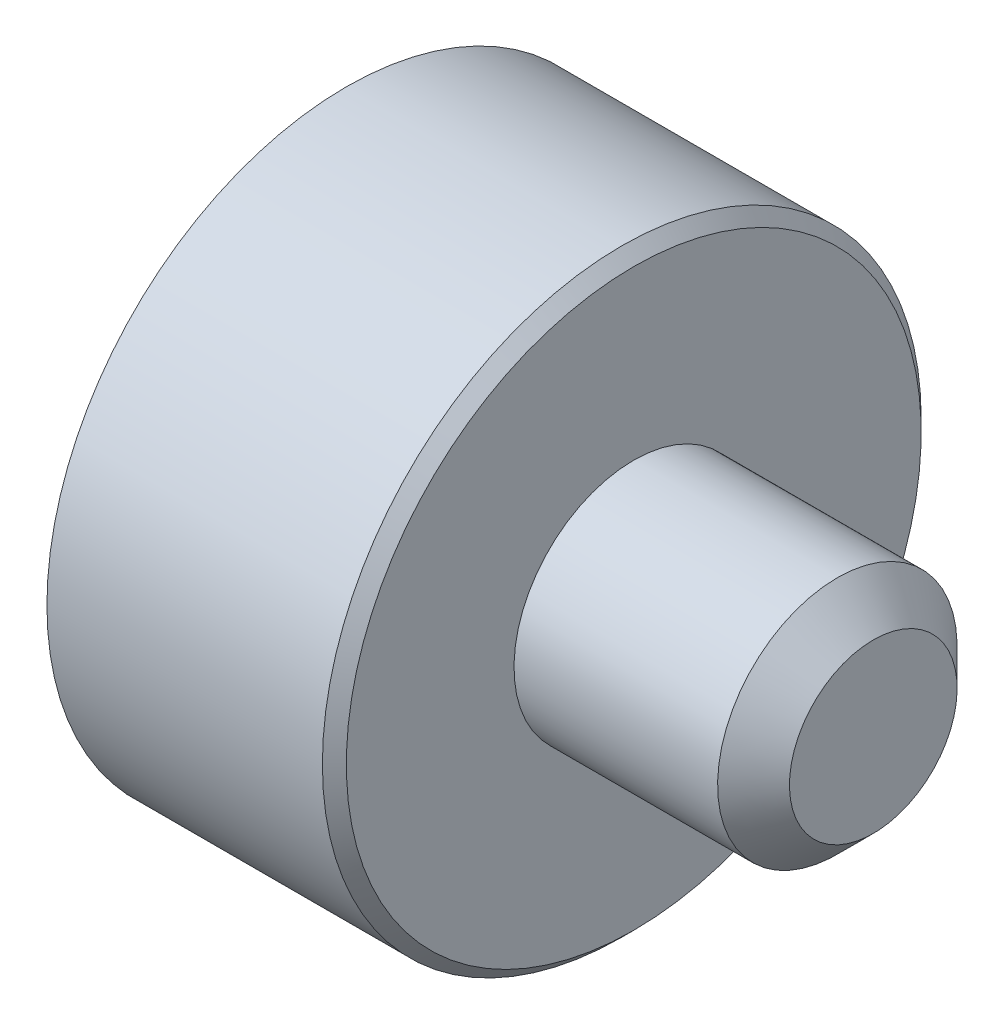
from build123d import *


with BuildPart() as part:
    # Sketch 1 → Revolve 1 (revolve)
    with BuildSketch(Plane.XY):
        Polygon((0, 0), (0, 5), (5, 5), (5, 12.5), (16.5, 12.5), (17, 12), (17, 5), (25.5, 5), (27, 3.5), (27, 0), align=None)
    revolve(axis=Axis((27, 0, 0), (-1, 0, 0)))


solid = part.part
